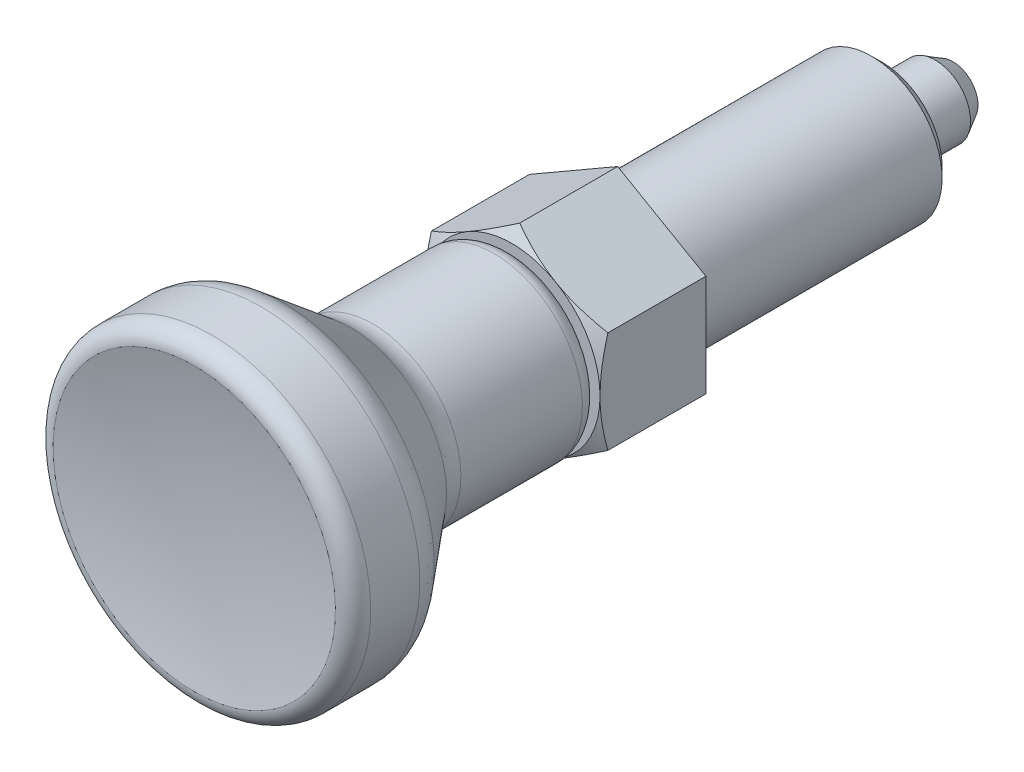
ISO-10303-21;
HEADER;
FILE_DESCRIPTION(('STEP AP214'),'2;1');
FILE_NAME('part.step','',(''),(''),'','','');
FILE_SCHEMA(('AUTOMOTIVE_DESIGN { 1 0 10303 214 1 1 1 1 }'));
ENDSEC;
DATA;
#1=APPLICATION_CONTEXT('core data for automotive mechanical design processes');
#2=APPLICATION_PROTOCOL_DEFINITION('international standard','automotive_design',2000,#1);
#3=PRODUCT_CONTEXT('',#1,'mechanical');
#4=PRODUCT('Part','Part','',(#3));
#5=PRODUCT_RELATED_PRODUCT_CATEGORY('part','',(#4));
#6=PRODUCT_DEFINITION_FORMATION('','',#4);
#7=PRODUCT_DEFINITION_CONTEXT('part definition',#1,'design');
#8=PRODUCT_DEFINITION('design','',#6,#7);
#9=PRODUCT_DEFINITION_SHAPE('','',#8);
#10=(LENGTH_UNIT() NAMED_UNIT(*) SI_UNIT(.MILLI.,.METRE.));
#11=(NAMED_UNIT(*) PLANE_ANGLE_UNIT() SI_UNIT($,.RADIAN.));
#12=(NAMED_UNIT(*) SI_UNIT($,.STERADIAN.) SOLID_ANGLE_UNIT());
#13=UNCERTAINTY_MEASURE_WITH_UNIT(LENGTH_MEASURE(1.E-05),#10,'distance_accuracy_value','');
#14=(GEOMETRIC_REPRESENTATION_CONTEXT(3) GLOBAL_UNCERTAINTY_ASSIGNED_CONTEXT((#13)) GLOBAL_UNIT_ASSIGNED_CONTEXT((#10,
#11,#12)) REPRESENTATION_CONTEXT('',''));
#15=CARTESIAN_POINT('',(0.,0.,0.));
#16=DIRECTION('',(0.,0.,1.));
#17=DIRECTION('',(1.,0.,0.));
#18=AXIS2_PLACEMENT_3D('',#15,#16,#17);
#19=CARTESIAN_POINT('',(0.,0.,4.2679491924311));
#20=DIRECTION('',(0.,0.,-1.));
#21=DIRECTION('',(1.,0.,0.));
#22=AXIS2_PLACEMENT_3D('',#19,#20,#21);
#23=CONICAL_SURFACE('',#22,8.,1.0471975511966);
#24=CARTESIAN_POINT('',(-5.,7.83582824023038,3.52018185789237));
#25=CARTESIAN_POINT('',(-5.,7.61675258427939,3.62677894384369));
#26=CARTESIAN_POINT('',(-5.,7.39718272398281,3.73237731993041));
#27=CARTESIAN_POINT('',(-5.,6.95679209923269,3.94101657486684));
#28=CARTESIAN_POINT('',(-5.,6.73597115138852,4.04405706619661));
#29=CARTESIAN_POINT('',(-5.,6.29171673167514,4.24752156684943));
#30=CARTESIAN_POINT('',(-5.,6.06827562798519,4.34792896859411));
#31=CARTESIAN_POINT('',(-5.,5.61964466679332,4.54474266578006));
#32=CARTESIAN_POINT('',(-5.,5.39445489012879,4.64114914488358));
#33=CARTESIAN_POINT('',(-5.,4.93438073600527,4.83205603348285));
#34=CARTESIAN_POINT('',(-5.,4.69942447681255,4.92638413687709));
#35=CARTESIAN_POINT('',(-5.,4.22679335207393,5.10809698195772));
#36=CARTESIAN_POINT('',(-5.,3.98911818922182,5.19548095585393));
#37=CARTESIAN_POINT('',(-5.,3.51109032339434,5.361071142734));
#38=CARTESIAN_POINT('',(-5.,3.27074388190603,5.43929525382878));
#39=CARTESIAN_POINT('',(-5.,2.78660382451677,5.58410963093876));
#40=CARTESIAN_POINT('',(-5.,2.54281129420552,5.65070347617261));
#41=CARTESIAN_POINT('',(-5.,2.05301710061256,5.76875493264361));
#42=CARTESIAN_POINT('',(-5.,1.80703640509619,5.8202979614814));
#43=CARTESIAN_POINT('',(-5.,1.31193168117,5.90539626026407));
#44=CARTESIAN_POINT('',(-5.,1.06280797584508,5.9389533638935));
#45=CARTESIAN_POINT('',(-5.,0.565948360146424,5.98496717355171));
#46=CARTESIAN_POINT('',(-5.,0.318238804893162,5.99770143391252));
#47=CARTESIAN_POINT('',(-5.,-0.177377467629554,6.00172580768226));
#48=CARTESIAN_POINT('',(-5.,-0.42528418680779,5.99301571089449));
#49=CARTESIAN_POINT('',(-5.,-0.84377235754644,5.96083600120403));
#50=CARTESIAN_POINT('',(-5.,-1.01479089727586,5.94270146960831));
#51=CARTESIAN_POINT('',(-5.,-1.35562158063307,5.89731277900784));
#52=CARTESIAN_POINT('',(-5.,-1.52543356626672,5.87005744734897));
#53=CARTESIAN_POINT('',(-5.,-2.03280883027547,5.77603792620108));
#54=CARTESIAN_POINT('',(-5.,-2.36813213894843,5.69703587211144));
#55=CARTESIAN_POINT('',(-5.,-2.86963272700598,5.55946652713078));
#56=CARTESIAN_POINT('',(-5.,-3.03839424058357,5.50977811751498));
#57=CARTESIAN_POINT('',(-5.,-3.37427940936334,5.40509537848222));
#58=CARTESIAN_POINT('',(-5.,-3.54140305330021,5.35010101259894));
#59=CARTESIAN_POINT('',(-5.,-3.8740625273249,5.23570084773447));
#60=CARTESIAN_POINT('',(-5.,-4.03959882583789,5.17629639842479));
#61=CARTESIAN_POINT('',(-5.,-4.36929036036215,5.05378935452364));
#62=CARTESIAN_POINT('',(-5.,-4.53344561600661,4.99068681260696));
#63=CARTESIAN_POINT('',(-5.,-4.93359002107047,4.83251408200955));
#64=CARTESIAN_POINT('',(-5.,-5.16891080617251,4.73575576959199));
#65=CARTESIAN_POINT('',(-5.,-5.63743106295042,4.53721704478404));
#66=CARTESIAN_POINT('',(-5.,-5.87063037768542,4.43543626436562));
#67=CARTESIAN_POINT('',(-5.,-6.33531777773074,4.22790414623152));
#68=CARTESIAN_POINT('',(-5.,-6.56680543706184,4.12215185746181));
#69=CARTESIAN_POINT('',(-5.,-7.02832278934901,3.90750642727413));
#70=CARTESIAN_POINT('',(-5.,-7.25835244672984,3.79861320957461));
#71=CARTESIAN_POINT('',(-5.,-7.71747583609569,3.57816832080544));
#72=CARTESIAN_POINT('',(-5.,-7.94656809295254,3.46661358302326));
#73=CARTESIAN_POINT('',(-5.,-8.40373705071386,3.2414402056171));
#74=CARTESIAN_POINT('',(-5.,-8.63181374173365,3.12782154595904));
#75=CARTESIAN_POINT('',(-5.,-9.31470112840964,2.78447519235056));
#76=CARTESIAN_POINT('',(-5.,-9.76824174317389,2.55222195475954));
#77=CARTESIAN_POINT('',(-5.,-10.6324695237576,2.10400639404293));
#78=CARTESIAN_POINT('',(-5.,-11.0433644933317,1.88844288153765));
#79=CARTESIAN_POINT('',(-5.,-11.863638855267,1.45441184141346));
#80=CARTESIAN_POINT('',(-5.,-12.2730181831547,1.23594419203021));
#81=CARTESIAN_POINT('',(-5.,-13.0894643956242,0.797423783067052));
#82=CARTESIAN_POINT('',(-5.,-13.4965345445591,0.577377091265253));
#83=CARTESIAN_POINT('',(-5.,-14.3097130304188,0.135572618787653));
#84=CARTESIAN_POINT('',(-5.,-14.7158214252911,-0.0861850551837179));
#85=CARTESIAN_POINT('',(-5.,-15.1215799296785,-0.308576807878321));
#86=B_SPLINE_CURVE_WITH_KNOTS('',3,(#24,#25,#26,#27,#28,#29,#30,#31,#32,#33,#34,#35,#36,#37,#38,
#39,#40,#41,#42,#43,#44,#45,#46,#47,#48,#49,#50,#51,#52,#53,#54,#55,#56,#57,#58,#59,#60,#61,#62,
#63,#64,#65,#66,#67,#68,#69,#70,#71,#72,#73,#74,#75,#76,#77,#78,#79,#80,#81,#82,#83,#84,#85),
.UNSPECIFIED.,.F.,.F.,(4,2,2,2,2,2,2,2,2,2,2,2,2,2,2,2,2,2,2,2,2,2,2,2,2,2,2,2,2,2,4),(0.,
0.730907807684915,1.46192568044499,2.19678752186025,2.93161559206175,3.69108328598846,
4.45063483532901,5.20867656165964,5.96648458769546,6.71990430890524,7.47324720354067,
8.21646418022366,8.95968844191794,9.47537174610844,9.99112137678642,11.0231580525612,
11.5508843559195,12.0786142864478,12.6061833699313,13.1337449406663,13.8969744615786,
14.6602599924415,15.4237294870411,16.1872175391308,16.9516324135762,17.7160547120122,
19.2446573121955,20.6366654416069,22.0287321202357,23.4169424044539,24.8050668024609),.UNSPECIFIED.);
#87=CARTESIAN_POINT('',(-5.,-2.8867513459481,5.55341801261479));
#88=VERTEX_POINT('',#87);
#89=CARTESIAN_POINT('',(-5.,0.,6.));
#90=VERTEX_POINT('',#89);
#91=EDGE_CURVE('E9',#88,#90,#86,.F.);
#92=ORIENTED_EDGE('',*,*,#91,.F.);
#93=CARTESIAN_POINT('',(0.000200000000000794,-5.77361816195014,5.55335134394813));
#94=CARTESIAN_POINT('',(-0.219534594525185,-5.64675433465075,5.62661343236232));
#95=CARTESIAN_POINT('',(-0.441148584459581,-5.51880543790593,5.69324867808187));
#96=CARTESIAN_POINT('',(-0.888213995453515,-5.26069210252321,5.80956100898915));
#97=CARTESIAN_POINT('',(-1.11367335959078,-5.13052307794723,5.85919695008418));
#98=CARTESIAN_POINT('',(-1.56183230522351,-4.87177839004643,5.93644897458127));
#99=CARTESIAN_POINT('',(-1.7844620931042,-4.74324302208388,5.96457962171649));
#100=CARTESIAN_POINT('',(-2.11918990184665,-4.54998783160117,5.98980507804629));
#101=CARTESIAN_POINT('',(-2.23084219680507,-4.48552534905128,5.99538654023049));
#102=CARTESIAN_POINT('',(-2.45424997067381,-4.35654081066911,6.00079778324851));
#103=CARTESIAN_POINT('',(-2.56600544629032,-4.2920187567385,6.00062774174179));
#104=CARTESIAN_POINT('',(-2.87218423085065,-4.11524635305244,5.99224636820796));
#105=CARTESIAN_POINT('',(-3.06650608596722,-4.00305457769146,5.97817022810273));
#106=CARTESIAN_POINT('',(-3.45386010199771,-3.77941563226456,5.93353474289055));
#107=CARTESIAN_POINT('',(-3.64689090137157,-3.66796924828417,5.90296013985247));
#108=CARTESIAN_POINT('',(-4.03502534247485,-3.44387972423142,5.82653150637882));
#109=CARTESIAN_POINT('',(-4.23007999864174,-3.33126486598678,5.7803536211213));
#110=CARTESIAN_POINT('',(-4.61728034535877,-3.10771464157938,5.67554820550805));
#111=CARTESIAN_POINT('',(-4.80943099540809,-2.99677641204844,5.61694529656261));
#112=CARTESIAN_POINT('',(-5.0002,-2.88663587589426,5.55335134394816));
#113=B_SPLINE_CURVE_WITH_KNOTS('',3,(#93,#94,#95,#96,#97,#98,#99,#100,#101,#102,#103,#104,#105,
#106,#107,#108,#109,#110,#111,#112),.UNSPECIFIED.,.F.,.F.,(4,2,2,2,2,2,2,2,2,4),(0.,
0.792555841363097,1.58701660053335,2.36181537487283,2.74884076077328,3.13585419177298,
3.80962362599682,4.48401723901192,5.17336882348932,5.86136694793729),.UNSPECIFIED.);
#114=CARTESIAN_POINT('',(-2.50000000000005,-4.33012701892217,6.));
#115=VERTEX_POINT('',#114);
#116=EDGE_CURVE('E209',#115,#88,#113,.T.);
#117=ORIENTED_EDGE('',*,*,#116,.F.);
#118=CARTESIAN_POINT('',(0.,0.,6.));
#119=DIRECTION('',(0.,0.,1.));
#120=DIRECTION('',(-1.,0.,0.));
#121=AXIS2_PLACEMENT_3D('',#118,#119,#120);
#122=CIRCLE('',#121,5.);
#123=EDGE_CURVE('E127',#90,#115,#122,.T.);
#124=ORIENTED_EDGE('',*,*,#123,.F.);
#125=EDGE_LOOP('',(#92,#117,#124));
#126=FACE_BOUND('',#125,.T.);
#127=ADVANCED_FACE('F14',(#126),#23,.T.);
#128=CARTESIAN_POINT('',(-5.,2.8867513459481,5.55341801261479));
#129=VERTEX_POINT('',#128);
#130=EDGE_CURVE('E18',#90,#129,#86,.F.);
#131=ORIENTED_EDGE('',*,*,#130,.F.);
#132=CARTESIAN_POINT('',(-2.50000000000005,4.33012701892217,6.));
#133=VERTEX_POINT('',#132);
#134=EDGE_CURVE('E119',#133,#90,#122,.T.);
#135=ORIENTED_EDGE('',*,*,#134,.F.);
#136=CARTESIAN_POINT('',(-5.0002,2.88663587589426,5.55335134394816));
#137=CARTESIAN_POINT('',(-4.78046540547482,3.01349970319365,5.62661343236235));
#138=CARTESIAN_POINT('',(-4.55885141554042,3.14144859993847,5.69324867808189));
#139=CARTESIAN_POINT('',(-4.11178600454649,3.39956193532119,5.80956100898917));
#140=CARTESIAN_POINT('',(-3.88632664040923,3.52973095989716,5.85919695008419));
#141=CARTESIAN_POINT('',(-3.43816769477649,3.78847564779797,5.93644897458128));
#142=CARTESIAN_POINT('',(-3.21553790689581,3.91701101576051,5.96457962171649));
#143=CARTESIAN_POINT('',(-2.88081009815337,4.11026620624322,5.98980507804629));
#144=CARTESIAN_POINT('',(-2.76915780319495,4.17472868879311,5.99538654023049));
#145=CARTESIAN_POINT('',(-2.54575002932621,4.30371322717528,6.00079778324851));
#146=CARTESIAN_POINT('',(-2.4339945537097,4.36823528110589,6.00062774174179));
#147=CARTESIAN_POINT('',(-2.12781576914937,4.54500768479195,5.99224636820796));
#148=CARTESIAN_POINT('',(-1.9334939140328,4.65719946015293,5.97817022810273));
#149=CARTESIAN_POINT('',(-1.5461398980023,4.88083840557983,5.93353474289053));
#150=CARTESIAN_POINT('',(-1.35310909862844,4.99228478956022,5.90296013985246));
#151=CARTESIAN_POINT('',(-0.96497465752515,5.21637431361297,5.8265315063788));
#152=CARTESIAN_POINT('',(-0.769920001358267,5.32898917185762,5.78035362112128));
#153=CARTESIAN_POINT('',(-0.382719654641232,5.55253939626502,5.67554820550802));
#154=CARTESIAN_POINT('',(-0.190569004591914,5.66347762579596,5.61694529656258));
#155=CARTESIAN_POINT('',(0.000200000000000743,5.77361816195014,5.55335134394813));
#156=B_SPLINE_CURVE_WITH_KNOTS('',3,(#136,#137,#138,#139,#140,#141,#142,#143,#144,#145,#146,
#147,#148,#149,#150,#151,#152,#153,#154,#155),.UNSPECIFIED.,.F.,.F.,(4,2,2,2,2,2,2,2,2,4),(0.,
0.792555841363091,1.58701660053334,2.36181537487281,2.74884076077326,3.13585419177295,
3.8096236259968,4.48401723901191,5.17336882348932,5.86136694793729),.UNSPECIFIED.);
#157=EDGE_CURVE('E268',#129,#133,#156,.T.);
#158=ORIENTED_EDGE('',*,*,#157,.F.);
#159=EDGE_LOOP('',(#131,#135,#158));
#160=FACE_BOUND('',#159,.T.);
#161=ADVANCED_FACE('F231',(#160),#23,.T.);
#162=CARTESIAN_POINT('',(0.,5.7735026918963,5.55341801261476));
#163=VERTEX_POINT('',#162);
#164=EDGE_CURVE('E115',#133,#163,#156,.T.);
#165=ORIENTED_EDGE('',*,*,#164,.F.);
#166=CARTESIAN_POINT('',(2.50000000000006,4.33012701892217,6.));
#167=VERTEX_POINT('',#166);
#168=EDGE_CURVE('E113',#167,#133,#122,.T.);
#169=ORIENTED_EDGE('',*,*,#168,.F.);
#170=CARTESIAN_POINT('',(-0.000199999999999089,5.77361816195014,5.55335134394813));
#171=CARTESIAN_POINT('',(0.219534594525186,5.64675433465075,5.62661343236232));
#172=CARTESIAN_POINT('',(0.441148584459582,5.51880543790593,5.69324867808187));
#173=CARTESIAN_POINT('',(0.888213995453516,5.26069210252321,5.80956100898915));
#174=CARTESIAN_POINT('',(1.11367335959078,5.13052307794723,5.85919695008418));
#175=CARTESIAN_POINT('',(1.56183230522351,4.87177839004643,5.93644897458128));
#176=CARTESIAN_POINT('',(1.7844620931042,4.74324302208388,5.96457962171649));
#177=CARTESIAN_POINT('',(2.11918990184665,4.54998783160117,5.98980507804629));
#178=CARTESIAN_POINT('',(2.23084219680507,4.48552534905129,5.99538654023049));
#179=CARTESIAN_POINT('',(2.45424997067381,4.35654081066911,6.00079778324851));
#180=CARTESIAN_POINT('',(2.56600544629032,4.2920187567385,6.00062774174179));
#181=CARTESIAN_POINT('',(2.87218423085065,4.11524635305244,5.99224636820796));
#182=CARTESIAN_POINT('',(3.06650608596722,4.00305457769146,5.97817022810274));
#183=CARTESIAN_POINT('',(3.45386010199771,3.77941563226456,5.93353474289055));
#184=CARTESIAN_POINT('',(3.64689090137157,3.66796924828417,5.90296013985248));
#185=CARTESIAN_POINT('',(4.03502534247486,3.44387972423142,5.82653150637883));
#186=CARTESIAN_POINT('',(4.23007999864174,3.33126486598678,5.78035362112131));
#187=CARTESIAN_POINT('',(4.61728034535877,3.10771464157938,5.67554820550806));
#188=CARTESIAN_POINT('',(4.80943099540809,2.99677641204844,5.61694529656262));
#189=CARTESIAN_POINT('',(5.0002,2.88663587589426,5.55335134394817));
#190=B_SPLINE_CURVE_WITH_KNOTS('',3,(#170,#171,#172,#173,#174,#175,#176,#177,#178,#179,#180,
#181,#182,#183,#184,#185,#186,#187,#188,#189),.UNSPECIFIED.,.F.,.F.,(4,2,2,2,2,2,2,2,2,4),(0.,
0.792555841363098,1.58701660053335,2.36181537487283,2.74884076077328,3.13585419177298,
3.80962362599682,4.48401723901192,5.17336882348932,5.86136694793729),.UNSPECIFIED.);
#191=EDGE_CURVE('E93',#163,#167,#190,.T.);
#192=ORIENTED_EDGE('',*,*,#191,.F.);
#193=EDGE_LOOP('',(#165,#169,#192));
#194=FACE_BOUND('',#193,.T.);
#195=ADVANCED_FACE('F114',(#194),#23,.T.);
#196=CARTESIAN_POINT('',(0.,-5.7735026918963,5.55341801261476));
#197=VERTEX_POINT('',#196);
#198=EDGE_CURVE('E204',#197,#115,#113,.T.);
#199=ORIENTED_EDGE('',*,*,#198,.F.);
#200=CARTESIAN_POINT('',(5.0002,-2.88663587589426,5.55335134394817));
#201=CARTESIAN_POINT('',(4.78046540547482,-3.01349970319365,5.62661343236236));
#202=CARTESIAN_POINT('',(4.55885141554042,-3.14144859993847,5.6932486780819));
#203=CARTESIAN_POINT('',(4.11178600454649,-3.39956193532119,5.80956100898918));
#204=CARTESIAN_POINT('',(3.88632664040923,-3.52973095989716,5.8591969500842));
#205=CARTESIAN_POINT('',(3.4381676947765,-3.78847564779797,5.93644897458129));
#206=CARTESIAN_POINT('',(3.21553790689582,-3.91701101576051,5.9645796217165));
#207=CARTESIAN_POINT('',(2.88081009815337,-4.11026620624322,5.9898050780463));
#208=CARTESIAN_POINT('',(2.76915780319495,-4.1747286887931,5.9953865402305));
#209=CARTESIAN_POINT('',(2.54575002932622,-4.30371322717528,6.00079778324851));
#210=CARTESIAN_POINT('',(2.4339945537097,-4.36823528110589,6.00062774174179));
#211=CARTESIAN_POINT('',(2.12781576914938,-4.54500768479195,5.99224636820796));
#212=CARTESIAN_POINT('',(1.9334939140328,-4.65719946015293,5.97817022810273));
#213=CARTESIAN_POINT('',(1.54613989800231,-4.88083840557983,5.93353474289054));
#214=CARTESIAN_POINT('',(1.35310909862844,-4.99228478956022,5.90296013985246));
#215=CARTESIAN_POINT('',(0.964974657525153,-5.21637431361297,5.8265315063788));
#216=CARTESIAN_POINT('',(0.76992000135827,-5.32898917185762,5.78035362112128));
#217=CARTESIAN_POINT('',(0.382719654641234,-5.55253939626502,5.67554820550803));
#218=CARTESIAN_POINT('',(0.190569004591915,-5.66347762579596,5.61694529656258));
#219=CARTESIAN_POINT('',(-0.000199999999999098,-5.77361816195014,5.55335134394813));
#220=B_SPLINE_CURVE_WITH_KNOTS('',3,(#200,#201,#202,#203,#204,#205,#206,#207,#208,#209,#210,
#211,#212,#213,#214,#215,#216,#217,#218,#219),.UNSPECIFIED.,.F.,.F.,(4,2,2,2,2,2,2,2,2,4),(0.,
0.792555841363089,1.58701660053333,2.36181537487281,2.74884076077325,3.13585419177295,
3.8096236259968,4.48401723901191,5.17336882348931,5.86136694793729),.UNSPECIFIED.);
#221=CARTESIAN_POINT('',(2.50000000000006,-4.33012701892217,6.));
#222=VERTEX_POINT('',#221);
#223=EDGE_CURVE('E103',#222,#197,#220,.T.);
#224=ORIENTED_EDGE('',*,*,#223,.F.);
#225=EDGE_CURVE('E126',#115,#222,#122,.T.);
#226=ORIENTED_EDGE('',*,*,#225,.F.);
#227=EDGE_LOOP('',(#199,#224,#226));
#228=FACE_BOUND('',#227,.T.);
#229=ADVANCED_FACE('F249',(#228),#23,.T.);
#230=CARTESIAN_POINT('',(5.,2.8867513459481,5.5534180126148));
#231=VERTEX_POINT('',#230);
#232=EDGE_CURVE('E97',#167,#231,#190,.T.);
#233=ORIENTED_EDGE('',*,*,#232,.F.);
#234=CARTESIAN_POINT('',(5.,0.,6.));
#235=VERTEX_POINT('',#234);
#236=EDGE_CURVE('E109',#235,#167,#122,.T.);
#237=ORIENTED_EDGE('',*,*,#236,.F.);
#238=CARTESIAN_POINT('',(5.,7.83582824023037,3.52018185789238));
#239=CARTESIAN_POINT('',(5.,7.61675258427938,3.6267789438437));
#240=CARTESIAN_POINT('',(5.,7.39718272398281,3.73237731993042));
#241=CARTESIAN_POINT('',(5.,6.95679209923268,3.94101657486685));
#242=CARTESIAN_POINT('',(5.,6.73597115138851,4.04405706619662));
#243=CARTESIAN_POINT('',(5.,6.29171673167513,4.24752156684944));
#244=CARTESIAN_POINT('',(5.,6.06827562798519,4.34792896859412));
#245=CARTESIAN_POINT('',(5.,5.61964466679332,4.54474266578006));
#246=CARTESIAN_POINT('',(5.,5.39445489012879,4.64114914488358));
#247=CARTESIAN_POINT('',(5.,4.93438073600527,4.83205603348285));
#248=CARTESIAN_POINT('',(5.,4.69942447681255,4.9263841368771));
#249=CARTESIAN_POINT('',(5.,4.22679335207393,5.10809698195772));
#250=CARTESIAN_POINT('',(5.,3.98911818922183,5.19548095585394));
#251=CARTESIAN_POINT('',(5.,3.51109032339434,5.361071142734));
#252=CARTESIAN_POINT('',(5.,3.27074388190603,5.43929525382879));
#253=CARTESIAN_POINT('',(5.,2.78660382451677,5.58410963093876));
#254=CARTESIAN_POINT('',(5.,2.54281129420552,5.65070347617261));
#255=CARTESIAN_POINT('',(5.,2.05301710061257,5.76875493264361));
#256=CARTESIAN_POINT('',(5.,1.80703640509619,5.8202979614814));
#257=CARTESIAN_POINT('',(5.,1.31193168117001,5.90539626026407));
#258=CARTESIAN_POINT('',(5.,1.06280797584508,5.9389533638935));
#259=CARTESIAN_POINT('',(5.,0.56594836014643,5.98496717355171));
#260=CARTESIAN_POINT('',(5.,0.318238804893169,5.99770143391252));
#261=CARTESIAN_POINT('',(5.,-0.177377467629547,6.00172580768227));
#262=CARTESIAN_POINT('',(5.,-0.425284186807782,5.9930157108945));
#263=CARTESIAN_POINT('',(5.,-0.843772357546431,5.96083600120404));
#264=CARTESIAN_POINT('',(5.,-1.01479089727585,5.94270146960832));
#265=CARTESIAN_POINT('',(5.,-1.35562158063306,5.89731277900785));
#266=CARTESIAN_POINT('',(5.,-1.52543356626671,5.87005744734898));
#267=CARTESIAN_POINT('',(5.,-2.03280883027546,5.77603792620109));
#268=CARTESIAN_POINT('',(5.,-2.36813213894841,5.69703587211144));
#269=CARTESIAN_POINT('',(5.,-2.86963272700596,5.55946652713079));
#270=CARTESIAN_POINT('',(5.,-3.03839424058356,5.50977811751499));
#271=CARTESIAN_POINT('',(5.,-3.37427940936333,5.40509537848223));
#272=CARTESIAN_POINT('',(5.,-3.54140305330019,5.35010101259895));
#273=CARTESIAN_POINT('',(5.,-3.87406252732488,5.23570084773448));
#274=CARTESIAN_POINT('',(5.,-4.03959882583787,5.1762963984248));
#275=CARTESIAN_POINT('',(5.,-4.36929036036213,5.05378935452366));
#276=CARTESIAN_POINT('',(5.,-4.53344561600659,4.99068681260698));
#277=CARTESIAN_POINT('',(5.,-4.93359002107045,4.83251408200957));
#278=CARTESIAN_POINT('',(5.,-5.16891080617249,4.735755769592));
#279=CARTESIAN_POINT('',(5.,-5.6374310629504,4.53721704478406));
#280=CARTESIAN_POINT('',(5.,-5.87063037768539,4.43543626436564));
#281=CARTESIAN_POINT('',(5.,-6.33531777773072,4.22790414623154));
#282=CARTESIAN_POINT('',(5.,-6.56680543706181,4.12215185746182));
#283=CARTESIAN_POINT('',(5.,-7.02832278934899,3.90750642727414));
#284=CARTESIAN_POINT('',(5.,-7.25835244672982,3.79861320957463));
#285=CARTESIAN_POINT('',(5.,-7.71747583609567,3.57816832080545));
#286=CARTESIAN_POINT('',(5.,-7.94656809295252,3.46661358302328));
#287=CARTESIAN_POINT('',(5.,-8.40373705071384,3.24144020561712));
#288=CARTESIAN_POINT('',(5.,-8.63181374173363,3.12782154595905));
#289=CARTESIAN_POINT('',(5.,-9.31470112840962,2.78447519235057));
#290=CARTESIAN_POINT('',(5.,-9.76824174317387,2.55222195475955));
#291=CARTESIAN_POINT('',(5.,-10.6324695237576,2.10400639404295));
#292=CARTESIAN_POINT('',(5.,-11.0433644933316,1.88844288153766));
#293=CARTESIAN_POINT('',(5.,-11.863638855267,1.45441184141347));
#294=CARTESIAN_POINT('',(5.,-12.2730181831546,1.23594419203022));
#295=CARTESIAN_POINT('',(5.,-13.0894643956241,0.79742378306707));
#296=CARTESIAN_POINT('',(5.,-13.496534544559,0.577377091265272));
#297=CARTESIAN_POINT('',(5.,-14.3097130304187,0.135572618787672));
#298=CARTESIAN_POINT('',(5.,-14.715821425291,-0.0861850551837));
#299=CARTESIAN_POINT('',(5.,-15.1215799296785,-0.308576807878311));
#300=B_SPLINE_CURVE_WITH_KNOTS('',3,(#238,#239,#240,#241,#242,#243,#244,#245,#246,#247,#248,
#249,#250,#251,#252,#253,#254,#255,#256,#257,#258,#259,#260,#261,#262,#263,#264,#265,#266,#267,
#268,#269,#270,#271,#272,#273,#274,#275,#276,#277,#278,#279,#280,#281,#282,#283,#284,#285,#286,
#287,#288,#289,#290,#291,#292,#293,#294,#295,#296,#297,#298,#299),.UNSPECIFIED.,.F.,.F.,(4,2,2,
2,2,2,2,2,2,2,2,2,2,2,2,2,2,2,2,2,2,2,2,2,2,2,2,2,2,2,4),(0.,0.730907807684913,1.46192568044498,
2.19678752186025,2.93161559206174,3.69108328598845,4.450634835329,5.20867656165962,
5.96648458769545,6.71990430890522,7.47324720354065,8.21646418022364,8.95968844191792,
9.47537174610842,9.99112137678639,11.0231580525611,11.5508843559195,12.0786142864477,
12.6061833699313,13.1337449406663,13.8969744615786,14.6602599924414,15.4237294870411,
16.1872175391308,16.9516324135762,17.7160547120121,19.2446573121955,20.6366654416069,
22.0287321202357,23.4169424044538,24.8050668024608),.UNSPECIFIED.);
#301=EDGE_CURVE('E41',#231,#235,#300,.T.);
#302=ORIENTED_EDGE('',*,*,#301,.F.);
#303=EDGE_LOOP('',(#233,#237,#302));
#304=FACE_BOUND('',#303,.T.);
#305=ADVANCED_FACE('F107',(#304),#23,.T.);
#306=CARTESIAN_POINT('',(5.,-2.8867513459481,5.5534180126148));
#307=VERTEX_POINT('',#306);
#308=EDGE_CURVE('E111',#307,#222,#220,.T.);
#309=ORIENTED_EDGE('',*,*,#308,.F.);
#310=EDGE_CURVE('E174',#235,#307,#300,.T.);
#311=ORIENTED_EDGE('',*,*,#310,.F.);
#312=EDGE_CURVE('E125',#222,#235,#122,.T.);
#313=ORIENTED_EDGE('',*,*,#312,.F.);
#314=EDGE_LOOP('',(#309,#311,#313));
#315=FACE_BOUND('',#314,.T.);
#316=ADVANCED_FACE('F233',(#315),#23,.T.);
#317=CARTESIAN_POINT('',(0.,-0.100000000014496,59.1224999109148));
#318=DIRECTION('',(-1.,0.,0.));
#319=DIRECTION('',(0.,-1.,0.));
#320=AXIS2_PLACEMENT_3D('',#317,#318,#319);
#321=CIRCLE('',#320,35.9999999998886);
#322=TRIMMED_CURVE('',#321,(PARAMETER_VALUE(-1.57357410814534)),
(PARAMETER_VALUE(1.57357410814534)),.T.,.PARAMETER.);
#323=CARTESIAN_POINT('',(0.,0.,59.1224999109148));
#324=DIRECTION('',(0.,0.,1.));
#325=AXIS1_PLACEMENT('',#323,#324);
#326=SURFACE_OF_REVOLUTION('',#322,#325);
#327=CARTESIAN_POINT('',(0.,0.,24.));
#328=DIRECTION('',(0.,0.,1.));
#329=DIRECTION('',(0.,-1.,0.));
#330=AXIS2_PLACEMENT_3D('',#327,#328,#329);
#331=CIRCLE('',#330,8.00000000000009);
#332=CARTESIAN_POINT('',(0.,-8.00000000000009,24.));
#333=VERTEX_POINT('',#332);
#334=EDGE_CURVE('E171',#333,#333,#331,.T.);
#335=ORIENTED_EDGE('',*,*,#334,.T.);
#336=EDGE_LOOP('',(#335));
#337=FACE_BOUND('',#336,.T.);
#338=CARTESIAN_POINT('',(0.,0.,23.122638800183));
#339=VERTEX_POINT('',#338);
#340=VERTEX_LOOP('',#339);
#341=FACE_BOUND('',#340,.T.);
#342=ADVANCED_FACE('F16',(#337,#341),#326,.F.);
#343=CARTESIAN_POINT('',(0.,0.,23.0000000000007));
#344=DIRECTION('',(0.,0.,1.));
#345=DIRECTION('',(0.,-1.,0.));
#346=AXIS2_PLACEMENT_3D('',#343,#344,#345);
#347=TOROIDAL_SURFACE('',#346,8.00000000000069,0.999999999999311);
#348=CARTESIAN_POINT('',(0.,0.,23.));
#349=DIRECTION('',(0.,0.,1.));
#350=DIRECTION('',(0.,-1.,0.));
#351=AXIS2_PLACEMENT_3D('',#348,#349,#350);
#352=CIRCLE('',#351,9.);
#353=CARTESIAN_POINT('',(0.,-9.,23.));
#354=VERTEX_POINT('',#353);
#355=EDGE_CURVE('E168',#354,#354,#352,.T.);
#356=ORIENTED_EDGE('',*,*,#355,.T.);
#357=EDGE_LOOP('',(#356));
#358=FACE_BOUND('',#357,.T.);
#359=ORIENTED_EDGE('',*,*,#334,.F.);
#360=EDGE_LOOP('',(#359));
#361=FACE_BOUND('',#360,.T.);
#362=ADVANCED_FACE('F247',(#358,#361),#347,.T.);
#363=CARTESIAN_POINT('',(0.,0.,-94.));
#364=DIRECTION('',(0.,0.,1.));
#365=DIRECTION('',(0.,-1.,0.));
#366=AXIS2_PLACEMENT_3D('',#363,#364,#365);
#367=CYLINDRICAL_SURFACE('',#366,9.);
#368=CARTESIAN_POINT('',(0.,0.,20.212672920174));
#369=DIRECTION('',(0.,0.,1.));
#370=DIRECTION('',(0.,-1.,0.));
#371=AXIS2_PLACEMENT_3D('',#368,#369,#370);
#372=CIRCLE('',#371,9.);
#373=CARTESIAN_POINT('',(0.,-9.,20.212672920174));
#374=VERTEX_POINT('',#373);
#375=EDGE_CURVE('E165',#374,#374,#372,.T.);
#376=ORIENTED_EDGE('',*,*,#375,.T.);
#377=EDGE_LOOP('',(#376));
#378=FACE_BOUND('',#377,.T.);
#379=ORIENTED_EDGE('',*,*,#355,.F.);
#380=EDGE_LOOP('',(#379));
#381=FACE_BOUND('',#380,.T.);
#382=ADVANCED_FACE('F346',(#378,#381),#367,.T.);
#383=CARTESIAN_POINT('',(0.,0.,20.2126729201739));
#384=DIRECTION('',(0.,0.,1.));
#385=DIRECTION('',(0.,-1.,0.));
#386=AXIS2_PLACEMENT_3D('',#383,#384,#385);
#387=TOROIDAL_SURFACE('',#386,6.99999999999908,2.00000000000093);
#388=CARTESIAN_POINT('',(0.,0.,18.947919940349));
#389=DIRECTION('',(0.,0.,1.));
#390=DIRECTION('',(0.,-1.,0.));
#391=AXIS2_PLACEMENT_3D('',#388,#389,#390);
#392=CIRCLE('',#391,8.549322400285);
#393=CARTESIAN_POINT('',(0.,-8.549322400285,18.947919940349));
#394=VERTEX_POINT('',#393);
#395=EDGE_CURVE('E162',#394,#394,#392,.T.);
#396=ORIENTED_EDGE('',*,*,#395,.T.);
#397=EDGE_LOOP('',(#396));
#398=FACE_BOUND('',#397,.T.);
#399=ORIENTED_EDGE('',*,*,#375,.F.);
#400=EDGE_LOOP('',(#399));
#401=FACE_BOUND('',#400,.T.);
#402=ADVANCED_FACE('F342',(#398,#401),#387,.T.);
#403=CARTESIAN_POINT('',(0.,0.,18.947919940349));
#404=DIRECTION('',(0.,0.,1.));
#405=DIRECTION('',(0.,-1.,0.));
#406=AXIS2_PLACEMENT_3D('',#403,#404,#405);
#407=CONICAL_SURFACE('',#406,8.549322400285,0.684617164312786);
#408=CARTESIAN_POINT('',(0.,0.,15.1520800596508));
#409=DIRECTION('',(0.,0.,1.));
#410=DIRECTION('',(0.,-1.,0.));
#411=AXIS2_PLACEMENT_3D('',#408,#409,#410);
#412=CIRCLE('',#411,5.450677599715);
#413=CARTESIAN_POINT('',(0.,-5.450677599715,15.1520800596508));
#414=VERTEX_POINT('',#413);
#415=EDGE_CURVE('E159',#414,#414,#412,.T.);
#416=ORIENTED_EDGE('',*,*,#415,.T.);
#417=EDGE_LOOP('',(#416));
#418=FACE_BOUND('',#417,.T.);
#419=ORIENTED_EDGE('',*,*,#395,.F.);
#420=EDGE_LOOP('',(#419));
#421=FACE_BOUND('',#420,.T.);
#422=ADVANCED_FACE('F338',(#418,#421),#407,.T.);
#423=CARTESIAN_POINT('',(0.,0.,13.8873270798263));
#424=DIRECTION('',(0.,0.,1.));
#425=DIRECTION('',(0.,-1.,0.));
#426=AXIS2_PLACEMENT_3D('',#423,#424,#425);
#427=TOROIDAL_SURFACE('',#426,6.99999999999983,1.99999999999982);
#428=CARTESIAN_POINT('',(0.,0.,13.8873270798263));
#429=DIRECTION('',(0.,0.,1.));
#430=DIRECTION('',(0.,-1.,0.));
#431=AXIS2_PLACEMENT_3D('',#428,#429,#430);
#432=CIRCLE('',#431,5.);
#433=CARTESIAN_POINT('',(0.,-5.,13.8873270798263));
#434=VERTEX_POINT('',#433);
#435=EDGE_CURVE('E156',#434,#434,#432,.T.);
#436=ORIENTED_EDGE('',*,*,#435,.T.);
#437=EDGE_LOOP('',(#436));
#438=FACE_BOUND('',#437,.T.);
#439=ORIENTED_EDGE('',*,*,#415,.F.);
#440=EDGE_LOOP('',(#439));
#441=FACE_BOUND('',#440,.T.);
#442=ADVANCED_FACE('F334',(#438,#441),#427,.F.);
#443=CARTESIAN_POINT('',(0.,0.,-94.));
#444=DIRECTION('',(0.,0.,1.));
#445=DIRECTION('',(0.,-1.,0.));
#446=AXIS2_PLACEMENT_3D('',#443,#444,#445);
#447=CYLINDRICAL_SURFACE('',#446,5.);
#448=CARTESIAN_POINT('',(0.,0.,7.));
#449=DIRECTION('',(0.,0.,1.));
#450=DIRECTION('',(0.,-1.,0.));
#451=AXIS2_PLACEMENT_3D('',#448,#449,#450);
#452=CIRCLE('',#451,5.);
#453=CARTESIAN_POINT('',(0.,-5.,7.));
#454=VERTEX_POINT('',#453);
#455=EDGE_CURVE('E153',#454,#454,#452,.T.);
#456=ORIENTED_EDGE('',*,*,#455,.T.);
#457=EDGE_LOOP('',(#456));
#458=FACE_BOUND('',#457,.T.);
#459=ORIENTED_EDGE('',*,*,#435,.F.);
#460=EDGE_LOOP('',(#459));
#461=FACE_BOUND('',#460,.T.);
#462=ADVANCED_FACE('F330',(#458,#461),#447,.T.);
#463=CARTESIAN_POINT('',(0.,0.,7.00000000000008));
#464=DIRECTION('',(0.,0.,1.));
#465=DIRECTION('',(0.,-1.,0.));
#466=AXIS2_PLACEMENT_3D('',#463,#464,#465);
#467=TOROIDAL_SURFACE('',#466,3.99999999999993,1.00000000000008);
#468=CARTESIAN_POINT('',(0.,0.,6.));
#469=DIRECTION('',(0.,0.,1.));
#470=DIRECTION('',(0.,-1.,0.));
#471=AXIS2_PLACEMENT_3D('',#468,#469,#470);
#472=CIRCLE('',#471,4.);
#473=CARTESIAN_POINT('',(0.,-4.,6.));
#474=VERTEX_POINT('',#473);
#475=EDGE_CURVE('E150',#474,#474,#472,.T.);
#476=ORIENTED_EDGE('',*,*,#475,.T.);
#477=EDGE_LOOP('',(#476));
#478=FACE_BOUND('',#477,.T.);
#479=ORIENTED_EDGE('',*,*,#455,.F.);
#480=EDGE_LOOP('',(#479));
#481=FACE_BOUND('',#480,.T.);
#482=ADVANCED_FACE('F316',(#478,#481),#467,.T.);
#483=CARTESIAN_POINT('',(5.,0.,6.));
#484=DIRECTION('',(0.,0.,-1.));
#485=DIRECTION('',(1.,0.,0.));
#486=AXIS2_PLACEMENT_3D('',#483,#484,#485);
#487=PLANE('',#486);
#488=ORIENTED_EDGE('',*,*,#475,.F.);
#489=EDGE_LOOP('',(#488));
#490=FACE_BOUND('',#489,.T.);
#491=ORIENTED_EDGE('',*,*,#123,.T.);
#492=ORIENTED_EDGE('',*,*,#225,.T.);
#493=ORIENTED_EDGE('',*,*,#312,.T.);
#494=ORIENTED_EDGE('',*,*,#236,.T.);
#495=ORIENTED_EDGE('',*,*,#168,.T.);
#496=ORIENTED_EDGE('',*,*,#134,.T.);
#497=EDGE_LOOP('',(#491,#492,#493,#494,#495,#496));
#498=FACE_BOUND('',#497,.T.);
#499=ADVANCED_FACE('F122',(#490,#498),#487,.F.);
#500=CARTESIAN_POINT('',(5.,2.8867513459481,-2.));
#501=DIRECTION('',(0.500000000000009,0.866025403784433,0.));
#502=DIRECTION('',(-0.866025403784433,0.500000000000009,0.));
#503=AXIS2_PLACEMENT_3D('',#500,#501,#502);
#504=PLANE('',#503);
#505=DIRECTION('',(-0.866025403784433,0.500000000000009,0.));
#506=VECTOR('',#505,1.);
#507=CARTESIAN_POINT('',(5.5,2.59807621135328,0.));
#508=LINE('',#507,#506);
#509=CARTESIAN_POINT('',(5.,2.8867513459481,0.));
#510=VERTEX_POINT('',#509);
#511=CARTESIAN_POINT('',(0.,5.7735026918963,0.));
#512=VERTEX_POINT('',#511);
#513=EDGE_CURVE('E131',#510,#512,#508,.T.);
#514=ORIENTED_EDGE('',*,*,#513,.T.);
#515=DIRECTION('',(0.,0.,1.));
#516=VECTOR('',#515,1.);
#517=CARTESIAN_POINT('',(0.,5.7735026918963,-2.));
#518=LINE('',#517,#516);
#519=EDGE_CURVE('E99',#512,#163,#518,.T.);
#520=ORIENTED_EDGE('',*,*,#519,.T.);
#521=ORIENTED_EDGE('',*,*,#191,.T.);
#522=ORIENTED_EDGE('',*,*,#232,.T.);
#523=DIRECTION('',(0.,0.,1.));
#524=VECTOR('',#523,1.);
#525=CARTESIAN_POINT('',(5.,2.8867513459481,-2.));
#526=LINE('',#525,#524);
#527=EDGE_CURVE('E289',#510,#231,#526,.T.);
#528=ORIENTED_EDGE('',*,*,#527,.F.);
#529=EDGE_LOOP('',(#514,#520,#521,#522,#528));
#530=FACE_BOUND('',#529,.T.);
#531=ADVANCED_FACE('F95',(#530),#504,.T.);
#532=CARTESIAN_POINT('',(0.,5.7735026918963,-2.));
#533=DIRECTION('',(-0.500000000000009,0.866025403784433,0.));
#534=DIRECTION('',(-0.866025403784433,-0.500000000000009,0.));
#535=AXIS2_PLACEMENT_3D('',#532,#533,#534);
#536=PLANE('',#535);
#537=DIRECTION('',(-0.866025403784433,-0.500000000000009,0.));
#538=VECTOR('',#537,1.);
#539=CARTESIAN_POINT('',(0.499999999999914,6.06217782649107,0.));
#540=LINE('',#539,#538);
#541=CARTESIAN_POINT('',(-5.,2.8867513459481,0.));
#542=VERTEX_POINT('',#541);
#543=EDGE_CURVE('E272',#512,#542,#540,.T.);
#544=ORIENTED_EDGE('',*,*,#543,.T.);
#545=DIRECTION('',(0.,0.,1.));
#546=VECTOR('',#545,1.);
#547=CARTESIAN_POINT('',(-5.,2.8867513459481,-2.));
#548=LINE('',#547,#546);
#549=EDGE_CURVE('E275',#542,#129,#548,.T.);
#550=ORIENTED_EDGE('',*,*,#549,.T.);
#551=ORIENTED_EDGE('',*,*,#157,.T.);
#552=ORIENTED_EDGE('',*,*,#164,.T.);
#553=ORIENTED_EDGE('',*,*,#519,.F.);
#554=EDGE_LOOP('',(#544,#550,#551,#552,#553));
#555=FACE_BOUND('',#554,.T.);
#556=ADVANCED_FACE('F198',(#555),#536,.T.);
#557=CARTESIAN_POINT('',(-5.,2.8867513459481,-2.));
#558=DIRECTION('',(-1.,0.,0.));
#559=DIRECTION('',(0.,-1.,0.));
#560=AXIS2_PLACEMENT_3D('',#557,#558,#559);
#561=PLANE('',#560);
#562=DIRECTION('',(0.,-1.,0.));
#563=VECTOR('',#562,1.);
#564=CARTESIAN_POINT('',(-5.,0.,0.));
#565=LINE('',#564,#563);
#566=CARTESIAN_POINT('',(-5.,-2.8867513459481,0.));
#567=VERTEX_POINT('',#566);
#568=EDGE_CURVE('E282',#542,#567,#565,.T.);
#569=ORIENTED_EDGE('',*,*,#568,.T.);
#570=DIRECTION('',(0.,0.,1.));
#571=VECTOR('',#570,1.);
#572=CARTESIAN_POINT('',(-5.,-2.8867513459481,-2.));
#573=LINE('',#572,#571);
#574=EDGE_CURVE('E264',#567,#88,#573,.T.);
#575=ORIENTED_EDGE('',*,*,#574,.T.);
#576=ORIENTED_EDGE('',*,*,#91,.T.);
#577=ORIENTED_EDGE('',*,*,#130,.T.);
#578=ORIENTED_EDGE('',*,*,#549,.F.);
#579=EDGE_LOOP('',(#569,#575,#576,#577,#578));
#580=FACE_BOUND('',#579,.T.);
#581=ADVANCED_FACE('F218',(#580),#561,.T.);
#582=CARTESIAN_POINT('',(-5.,-2.8867513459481,-2.));
#583=DIRECTION('',(-0.500000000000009,-0.866025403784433,0.));
#584=DIRECTION('',(0.866025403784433,-0.500000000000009,0.));
#585=AXIS2_PLACEMENT_3D('',#582,#583,#584);
#586=PLANE('',#585);
#587=DIRECTION('',(0.866025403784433,-0.500000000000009,0.));
#588=VECTOR('',#587,1.);
#589=CARTESIAN_POINT('',(0.499999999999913,-6.06217782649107,0.));
#590=LINE('',#589,#588);
#591=CARTESIAN_POINT('',(0.,-5.7735026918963,0.));
#592=VERTEX_POINT('',#591);
#593=EDGE_CURVE('E263',#567,#592,#590,.T.);
#594=ORIENTED_EDGE('',*,*,#593,.T.);
#595=DIRECTION('',(0.,0.,1.));
#596=VECTOR('',#595,1.);
#597=CARTESIAN_POINT('',(0.,-5.7735026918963,-2.));
#598=LINE('',#597,#596);
#599=EDGE_CURVE('E255',#592,#197,#598,.T.);
#600=ORIENTED_EDGE('',*,*,#599,.T.);
#601=ORIENTED_EDGE('',*,*,#198,.T.);
#602=ORIENTED_EDGE('',*,*,#116,.T.);
#603=ORIENTED_EDGE('',*,*,#574,.F.);
#604=EDGE_LOOP('',(#594,#600,#601,#602,#603));
#605=FACE_BOUND('',#604,.T.);
#606=ADVANCED_FACE('F215',(#605),#586,.T.);
#607=CARTESIAN_POINT('',(0.,-5.7735026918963,-2.));
#608=DIRECTION('',(0.500000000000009,-0.866025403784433,0.));
#609=DIRECTION('',(0.866025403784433,0.500000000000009,0.));
#610=AXIS2_PLACEMENT_3D('',#607,#608,#609);
#611=PLANE('',#610);
#612=DIRECTION('',(0.866025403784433,0.500000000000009,0.));
#613=VECTOR('',#612,1.);
#614=CARTESIAN_POINT('',(5.5,-2.59807621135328,0.));
#615=LINE('',#614,#613);
#616=CARTESIAN_POINT('',(5.,-2.8867513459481,0.));
#617=VERTEX_POINT('',#616);
#618=EDGE_CURVE('E286',#592,#617,#615,.T.);
#619=ORIENTED_EDGE('',*,*,#618,.T.);
#620=DIRECTION('',(0.,0.,1.));
#621=VECTOR('',#620,1.);
#622=CARTESIAN_POINT('',(5.,-2.8867513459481,-2.));
#623=LINE('',#622,#621);
#624=EDGE_CURVE('E35',#617,#307,#623,.T.);
#625=ORIENTED_EDGE('',*,*,#624,.T.);
#626=ORIENTED_EDGE('',*,*,#308,.T.);
#627=ORIENTED_EDGE('',*,*,#223,.T.);
#628=ORIENTED_EDGE('',*,*,#599,.F.);
#629=EDGE_LOOP('',(#619,#625,#626,#627,#628));
#630=FACE_BOUND('',#629,.T.);
#631=ADVANCED_FACE('F193',(#630),#611,.T.);
#632=CARTESIAN_POINT('',(5.,-2.8867513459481,-2.));
#633=DIRECTION('',(1.,0.,0.));
#634=DIRECTION('',(0.,1.,0.));
#635=AXIS2_PLACEMENT_3D('',#632,#633,#634);
#636=PLANE('',#635);
#637=DIRECTION('',(0.,1.,0.));
#638=VECTOR('',#637,1.);
#639=CARTESIAN_POINT('',(5.,0.,0.));
#640=LINE('',#639,#638);
#641=EDGE_CURVE('E274',#617,#510,#640,.T.);
#642=ORIENTED_EDGE('',*,*,#641,.T.);
#643=ORIENTED_EDGE('',*,*,#527,.T.);
#644=ORIENTED_EDGE('',*,*,#301,.T.);
#645=ORIENTED_EDGE('',*,*,#310,.T.);
#646=ORIENTED_EDGE('',*,*,#624,.F.);
#647=EDGE_LOOP('',(#642,#643,#644,#645,#646));
#648=FACE_BOUND('',#647,.T.);
#649=ADVANCED_FACE('F189',(#648),#636,.T.);
#650=CARTESIAN_POINT('',(1.4226497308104,0.,-19.));
#651=DIRECTION('',(0.,0.,-1.));
#652=DIRECTION('',(0.,1.,0.));
#653=AXIS2_PLACEMENT_3D('',#650,#651,#652);
#654=PLANE('',#653);
#655=CARTESIAN_POINT('',(0.,0.,-19.));
#656=DIRECTION('',(0.,0.,1.));
#657=DIRECTION('',(0.,-1.,0.));
#658=AXIS2_PLACEMENT_3D('',#655,#656,#657);
#659=CIRCLE('',#658,1.4226497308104);
#660=CARTESIAN_POINT('',(0.,-1.4226497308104,-19.));
#661=VERTEX_POINT('',#660);
#662=EDGE_CURVE('E144',#661,#661,#659,.T.);
#663=ORIENTED_EDGE('',*,*,#662,.F.);
#664=EDGE_LOOP('',(#663));
#665=FACE_BOUND('',#664,.T.);
#666=ADVANCED_FACE('F192',(#665),#654,.T.);
#667=CARTESIAN_POINT('',(0.,0.,-18.));
#668=DIRECTION('',(0.,0.,1.));
#669=DIRECTION('',(0.,-1.,0.));
#670=AXIS2_PLACEMENT_3D('',#667,#668,#669);
#671=CONICAL_SURFACE('',#670,2.,0.523598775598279);
#672=ORIENTED_EDGE('',*,*,#662,.T.);
#673=EDGE_LOOP('',(#672));
#674=FACE_BOUND('',#673,.T.);
#675=CARTESIAN_POINT('',(0.,0.,-18.));
#676=DIRECTION('',(0.,0.,1.));
#677=DIRECTION('',(0.,-1.,0.));
#678=AXIS2_PLACEMENT_3D('',#675,#676,#677);
#679=CIRCLE('',#678,2.);
#680=CARTESIAN_POINT('',(0.,-2.,-18.));
#681=VERTEX_POINT('',#680);
#682=EDGE_CURVE('E147',#681,#681,#679,.T.);
#683=ORIENTED_EDGE('',*,*,#682,.F.);
#684=EDGE_LOOP('',(#683));
#685=FACE_BOUND('',#684,.T.);
#686=ADVANCED_FACE('F320',(#674,#685),#671,.T.);
#687=CARTESIAN_POINT('',(0.,0.,-94.));
#688=DIRECTION('',(0.,0.,1.));
#689=DIRECTION('',(0.,-1.,0.));
#690=AXIS2_PLACEMENT_3D('',#687,#688,#689);
#691=CYLINDRICAL_SURFACE('',#690,2.);
#692=ORIENTED_EDGE('',*,*,#682,.T.);
#693=EDGE_LOOP('',(#692));
#694=FACE_BOUND('',#693,.T.);
#695=CARTESIAN_POINT('',(0.,0.,-15.));
#696=DIRECTION('',(0.,0.,1.));
#697=DIRECTION('',(-1.,0.,0.));
#698=AXIS2_PLACEMENT_3D('',#695,#696,#697);
#699=CIRCLE('',#698,2.);
#700=CARTESIAN_POINT('',(-2.,0.,-15.));
#701=VERTEX_POINT('',#700);
#702=EDGE_CURVE('E141',#701,#701,#699,.T.);
#703=ORIENTED_EDGE('',*,*,#702,.F.);
#704=EDGE_LOOP('',(#703));
#705=FACE_BOUND('',#704,.T.);
#706=ADVANCED_FACE('F312',(#694,#705),#691,.T.);
#707=CARTESIAN_POINT('',(2.,0.,-15.));
#708=DIRECTION('',(0.,0.,1.));
#709=DIRECTION('',(-1.,0.,0.));
#710=AXIS2_PLACEMENT_3D('',#707,#708,#709);
#711=PLANE('',#710);
#712=CARTESIAN_POINT('',(0.,0.,-15.));
#713=DIRECTION('',(0.,0.,1.));
#714=DIRECTION('',(-1.,0.,0.));
#715=AXIS2_PLACEMENT_3D('',#712,#713,#714);
#716=CIRCLE('',#715,3.3865);
#717=CARTESIAN_POINT('',(-3.3865,0.,-15.));
#718=VERTEX_POINT('',#717);
#719=EDGE_CURVE('E138',#718,#718,#716,.T.);
#720=ORIENTED_EDGE('',*,*,#719,.F.);
#721=EDGE_LOOP('',(#720));
#722=FACE_BOUND('',#721,.T.);
#723=ORIENTED_EDGE('',*,*,#702,.T.);
#724=EDGE_LOOP('',(#723));
#725=FACE_BOUND('',#724,.T.);
#726=ADVANCED_FACE('F308',(#722,#725),#711,.F.);
#727=CARTESIAN_POINT('',(0.,0.,-15.));
#728=DIRECTION('',(0.,0.,1.));
#729=DIRECTION('',(-1.,0.,0.));
#730=AXIS2_PLACEMENT_3D('',#727,#728,#729);
#731=CONICAL_SURFACE('',#730,3.3865,0.785398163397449);
#732=CARTESIAN_POINT('',(0.,0.,-14.3865));
#733=DIRECTION('',(0.,0.,1.));
#734=DIRECTION('',(-1.,0.,0.));
#735=AXIS2_PLACEMENT_3D('',#732,#733,#734);
#736=CIRCLE('',#735,4.);
#737=CARTESIAN_POINT('',(-3.99999999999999,0.,-14.3865));
#738=VERTEX_POINT('',#737);
#739=EDGE_CURVE('E135',#738,#738,#736,.T.);
#740=ORIENTED_EDGE('',*,*,#739,.F.);
#741=EDGE_LOOP('',(#740));
#742=FACE_BOUND('',#741,.T.);
#743=ORIENTED_EDGE('',*,*,#719,.T.);
#744=EDGE_LOOP('',(#743));
#745=FACE_BOUND('',#744,.T.);
#746=ADVANCED_FACE('F302',(#742,#745),#731,.T.);
#747=CARTESIAN_POINT('',(0.,0.,-15.));
#748=DIRECTION('',(0.,0.,1.));
#749=DIRECTION('',(-1.,0.,0.));
#750=AXIS2_PLACEMENT_3D('',#747,#748,#749);
#751=CYLINDRICAL_SURFACE('',#750,4.);
#752=CARTESIAN_POINT('',(0.,0.,0.));
#753=DIRECTION('',(0.,0.,1.));
#754=DIRECTION('',(-1.,0.,0.));
#755=AXIS2_PLACEMENT_3D('',#752,#753,#754);
#756=CIRCLE('',#755,4.);
#757=CARTESIAN_POINT('',(-3.99999999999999,0.,0.));
#758=VERTEX_POINT('',#757);
#759=EDGE_CURVE('E130',#758,#758,#756,.T.);
#760=ORIENTED_EDGE('',*,*,#759,.F.);
#761=EDGE_LOOP('',(#760));
#762=FACE_BOUND('',#761,.T.);
#763=ORIENTED_EDGE('',*,*,#739,.T.);
#764=EDGE_LOOP('',(#763));
#765=FACE_BOUND('',#764,.T.);
#766=ADVANCED_FACE('F295',(#762,#765),#751,.T.);
#767=CARTESIAN_POINT('',(4.,0.,0.));
#768=DIRECTION('',(0.,0.,1.));
#769=DIRECTION('',(-1.,0.,0.));
#770=AXIS2_PLACEMENT_3D('',#767,#768,#769);
#771=PLANE('',#770);
#772=ORIENTED_EDGE('',*,*,#759,.T.);
#773=EDGE_LOOP('',(#772));
#774=FACE_BOUND('',#773,.T.);
#775=ORIENTED_EDGE('',*,*,#513,.F.);
#776=ORIENTED_EDGE('',*,*,#641,.F.);
#777=ORIENTED_EDGE('',*,*,#618,.F.);
#778=ORIENTED_EDGE('',*,*,#593,.F.);
#779=ORIENTED_EDGE('',*,*,#568,.F.);
#780=ORIENTED_EDGE('',*,*,#543,.F.);
#781=EDGE_LOOP('',(#775,#776,#777,#778,#779,#780));
#782=FACE_BOUND('',#781,.T.);
#783=ADVANCED_FACE('F280',(#774,#782),#771,.F.);
#784=CLOSED_SHELL('',(#127,#161,#195,#229,#305,#316,#342,#362,#382,#402,#422,#442,#462,#482,
#499,#531,#556,#581,#606,#631,#649,#666,#686,#706,#726,#746,#766,#783));
#785=MANIFOLD_SOLID_BREP('B1',#784);
#786=ADVANCED_BREP_SHAPE_REPRESENTATION('',(#18,#785),#14);
#787=SHAPE_DEFINITION_REPRESENTATION(#9,#786);
ENDSEC;
END-ISO-10303-21;
